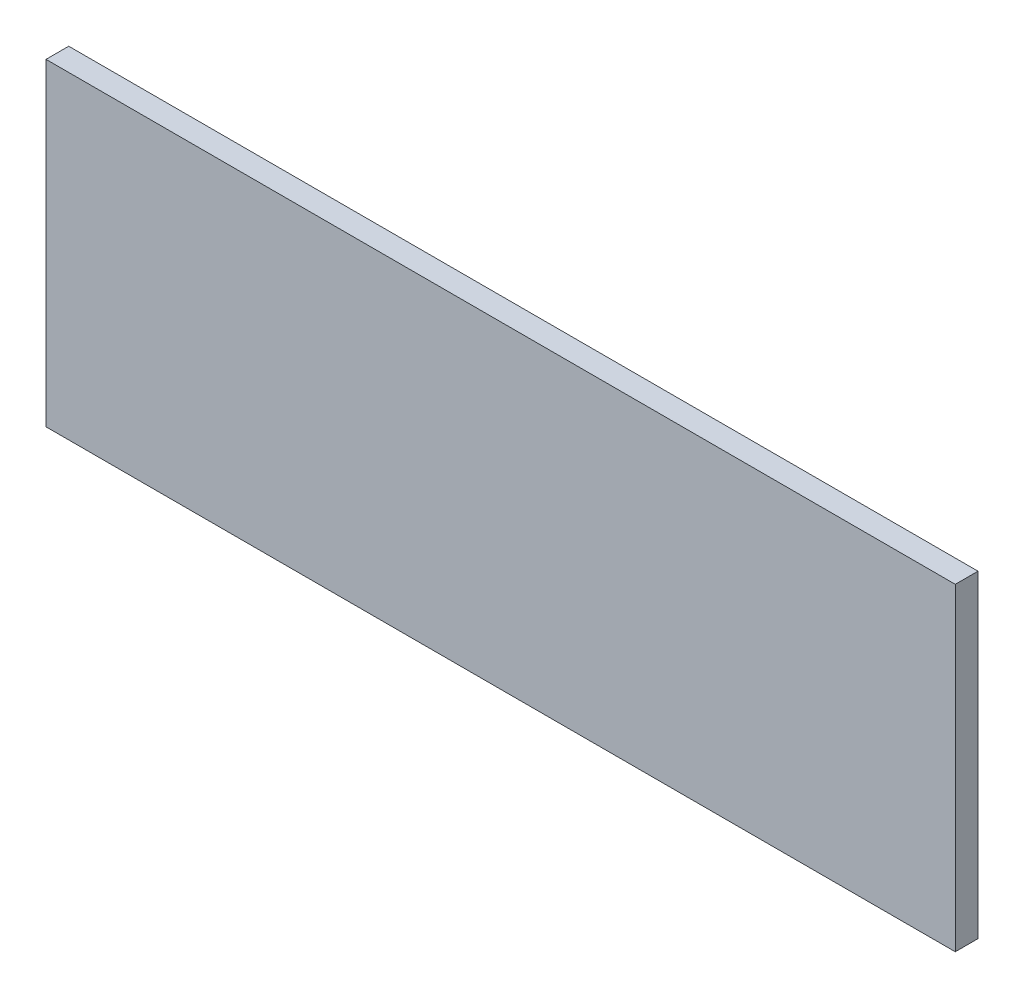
from build123d import *

# Parameters (mm, degrees)
SKETCH1_W           = 254
SKETCH1_H           = 88.9
BOSS_EXTRUDE1_DEPTH = 6.35


with BuildPart() as part:
    # Sketch1 → Boss-Extrude1 (new body)
    with BuildSketch(Plane.XY):
        with Locations((127, 44.45)):
            Rectangle(SKETCH1_W, SKETCH1_H)
    extrude(amount=BOSS_EXTRUDE1_DEPTH)


solid = part.part
